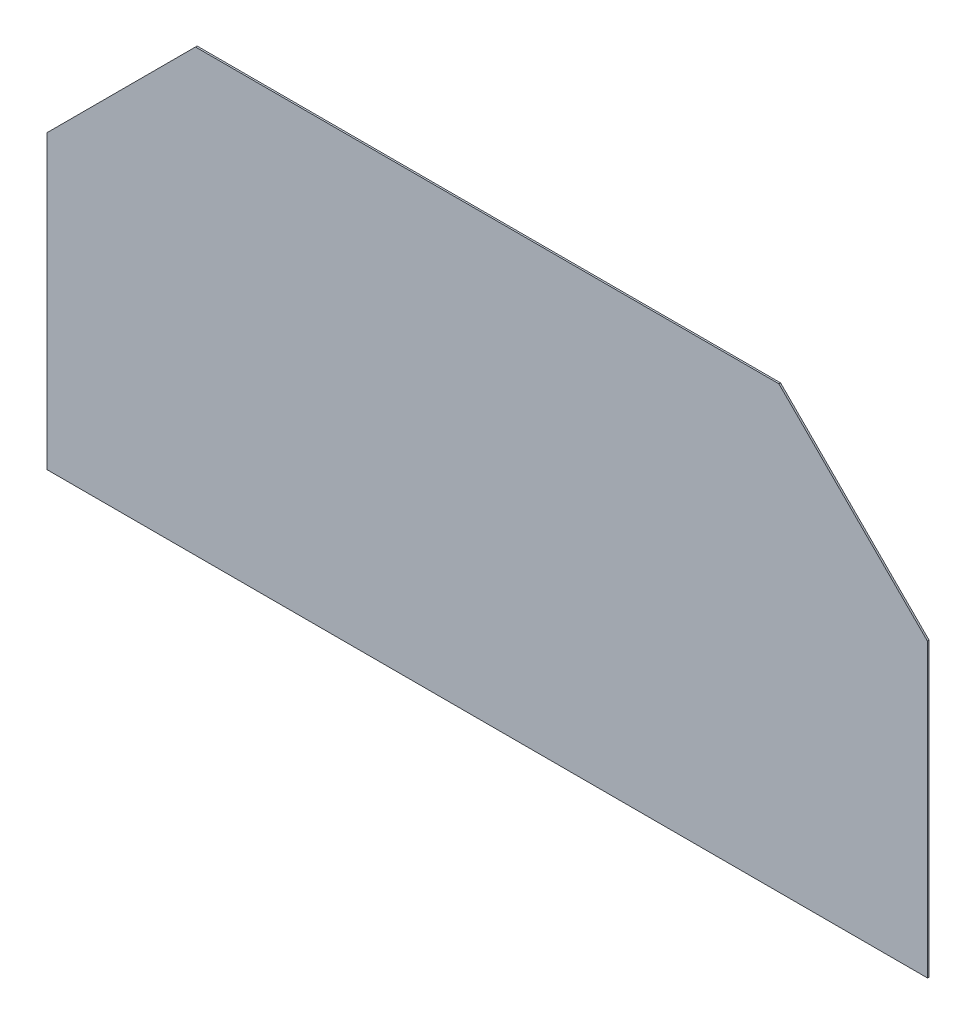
ISO-10303-21;
HEADER;
FILE_DESCRIPTION(('STEP AP214'),'2;1');
FILE_NAME('part.step','',(''),(''),'','','');
FILE_SCHEMA(('AUTOMOTIVE_DESIGN { 1 0 10303 214 1 1 1 1 }'));
ENDSEC;
DATA;
#1=APPLICATION_CONTEXT('core data for automotive mechanical design processes');
#2=APPLICATION_PROTOCOL_DEFINITION('international standard','automotive_design',2000,#1);
#3=PRODUCT_CONTEXT('',#1,'mechanical');
#4=PRODUCT('Part','Part','',(#3));
#5=PRODUCT_RELATED_PRODUCT_CATEGORY('part','',(#4));
#6=PRODUCT_DEFINITION_FORMATION('','',#4);
#7=PRODUCT_DEFINITION_CONTEXT('part definition',#1,'design');
#8=PRODUCT_DEFINITION('design','',#6,#7);
#9=PRODUCT_DEFINITION_SHAPE('','',#8);
#10=(LENGTH_UNIT() NAMED_UNIT(*) SI_UNIT(.MILLI.,.METRE.));
#11=(NAMED_UNIT(*) PLANE_ANGLE_UNIT() SI_UNIT($,.RADIAN.));
#12=(NAMED_UNIT(*) SI_UNIT($,.STERADIAN.) SOLID_ANGLE_UNIT());
#13=UNCERTAINTY_MEASURE_WITH_UNIT(LENGTH_MEASURE(1.E-05),#10,'distance_accuracy_value','');
#14=(GEOMETRIC_REPRESENTATION_CONTEXT(3) GLOBAL_UNCERTAINTY_ASSIGNED_CONTEXT((#13)) GLOBAL_UNIT_ASSIGNED_CONTEXT((#10,
#11,#12)) REPRESENTATION_CONTEXT('',''));
#15=CARTESIAN_POINT('',(0.,0.,0.));
#16=DIRECTION('',(0.,0.,1.));
#17=DIRECTION('',(1.,0.,0.));
#18=AXIS2_PLACEMENT_3D('',#15,#16,#17);
#19=CARTESIAN_POINT('',(20.,-5.54473320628,0.15));
#20=DIRECTION('',(0.,0.,1.));
#21=DIRECTION('',(1.,0.,0.));
#22=AXIS2_PLACEMENT_3D('',#19,#20,#21);
#23=PLANE('',#22);
#24=DIRECTION('',(1.,0.,0.));
#25=VECTOR('',#24,1.);
#26=CARTESIAN_POINT('',(-6.5,16.203007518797,0.15));
#27=LINE('',#26,#25);
#28=CARTESIAN_POINT('',(-6.5,16.203007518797,0.15));
#29=VERTEX_POINT('',#28);
#30=CARTESIAN_POINT('',(46.5,16.203007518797,0.15));
#31=VERTEX_POINT('',#30);
#32=EDGE_CURVE('E66',#29,#31,#27,.T.);
#33=ORIENTED_EDGE('',*,*,#32,.F.);
#34=DIRECTION('',(-0.707106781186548,-0.707106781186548,0.));
#35=VECTOR('',#34,1.);
#36=CARTESIAN_POINT('',(-20.,2.703007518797,0.15));
#37=LINE('',#36,#35);
#38=CARTESIAN_POINT('',(-20.,2.703007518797,0.15));
#39=VERTEX_POINT('',#38);
#40=EDGE_CURVE('E93',#39,#29,#37,.F.);
#41=ORIENTED_EDGE('',*,*,#40,.F.);
#42=DIRECTION('',(0.,1.,0.));
#43=VECTOR('',#42,1.);
#44=CARTESIAN_POINT('',(-20.,-23.7969924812,0.15));
#45=LINE('',#44,#43);
#46=CARTESIAN_POINT('',(-20.,-23.7969924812,0.15));
#47=VERTEX_POINT('',#46);
#48=EDGE_CURVE('E97',#47,#39,#45,.T.);
#49=ORIENTED_EDGE('',*,*,#48,.F.);
#50=DIRECTION('',(1.,0.,0.));
#51=VECTOR('',#50,1.);
#52=CARTESIAN_POINT('',(60.,-23.7969924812,0.15));
#53=LINE('',#52,#51);
#54=CARTESIAN_POINT('',(60.,-23.7969924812,0.15));
#55=VERTEX_POINT('',#54);
#56=EDGE_CURVE('E82',#55,#47,#53,.F.);
#57=ORIENTED_EDGE('',*,*,#56,.F.);
#58=DIRECTION('',(0.,1.,0.));
#59=VECTOR('',#58,1.);
#60=CARTESIAN_POINT('',(60.,2.703007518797,0.15));
#61=LINE('',#60,#59);
#62=CARTESIAN_POINT('',(60.,2.703007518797,0.15));
#63=VERTEX_POINT('',#62);
#64=EDGE_CURVE('E20',#63,#55,#61,.F.);
#65=ORIENTED_EDGE('',*,*,#64,.F.);
#66=DIRECTION('',(-0.707106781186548,0.707106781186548,0.));
#67=VECTOR('',#66,1.);
#68=CARTESIAN_POINT('',(46.5,16.203007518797,0.15));
#69=LINE('',#68,#67);
#70=EDGE_CURVE('E71',#31,#63,#69,.F.);
#71=ORIENTED_EDGE('',*,*,#70,.F.);
#72=EDGE_LOOP('',(#33,#41,#49,#57,#65,#71));
#73=FACE_BOUND('',#72,.T.);
#74=ADVANCED_FACE('F17',(#73),#23,.T.);
#75=CARTESIAN_POINT('',(60.,2.703007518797,0.));
#76=DIRECTION('',(1.,0.,0.));
#77=DIRECTION('',(0.,0.,-1.));
#78=AXIS2_PLACEMENT_3D('',#75,#76,#77);
#79=PLANE('',#78);
#80=DIRECTION('',(0.,1.,0.));
#81=VECTOR('',#80,1.);
#82=CARTESIAN_POINT('',(60.,-5.54473320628,0.));
#83=LINE('',#82,#81);
#84=CARTESIAN_POINT('',(60.,-23.7969924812,0.));
#85=VERTEX_POINT('',#84);
#86=CARTESIAN_POINT('',(60.,2.703007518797,0.));
#87=VERTEX_POINT('',#86);
#88=EDGE_CURVE('E88',#85,#87,#83,.T.);
#89=ORIENTED_EDGE('',*,*,#88,.T.);
#90=DIRECTION('',(0.,0.,1.));
#91=VECTOR('',#90,1.);
#92=CARTESIAN_POINT('',(60.,2.703007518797,0.));
#93=LINE('',#92,#91);
#94=EDGE_CURVE('E76',#63,#87,#93,.F.);
#95=ORIENTED_EDGE('',*,*,#94,.F.);
#96=ORIENTED_EDGE('',*,*,#64,.T.);
#97=DIRECTION('',(0.,0.,-1.));
#98=VECTOR('',#97,1.);
#99=CARTESIAN_POINT('',(60.,-23.7969924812,0.));
#100=LINE('',#99,#98);
#101=EDGE_CURVE('E103',#85,#55,#100,.F.);
#102=ORIENTED_EDGE('',*,*,#101,.F.);
#103=EDGE_LOOP('',(#89,#95,#96,#102));
#104=FACE_BOUND('',#103,.T.);
#105=ADVANCED_FACE('F87',(#104),#79,.T.);
#106=CARTESIAN_POINT('',(46.5,16.203007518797,0.));
#107=DIRECTION('',(0.707106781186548,0.707106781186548,0.));
#108=DIRECTION('',(-0.707106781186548,0.707106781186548,0.));
#109=AXIS2_PLACEMENT_3D('',#106,#107,#108);
#110=PLANE('',#109);
#111=DIRECTION('',(-0.707106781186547,0.707106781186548,0.));
#112=VECTOR('',#111,1.);
#113=CARTESIAN_POINT('',(60.,2.703007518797,0.));
#114=LINE('',#113,#112);
#115=CARTESIAN_POINT('',(46.5,16.203007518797,0.));
#116=VERTEX_POINT('',#115);
#117=EDGE_CURVE('E106',#87,#116,#114,.T.);
#118=ORIENTED_EDGE('',*,*,#117,.T.);
#119=DIRECTION('',(0.,0.,1.));
#120=VECTOR('',#119,1.);
#121=CARTESIAN_POINT('',(46.5,16.203007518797,0.));
#122=LINE('',#121,#120);
#123=EDGE_CURVE('E78',#31,#116,#122,.F.);
#124=ORIENTED_EDGE('',*,*,#123,.F.);
#125=ORIENTED_EDGE('',*,*,#70,.T.);
#126=ORIENTED_EDGE('',*,*,#94,.T.);
#127=EDGE_LOOP('',(#118,#124,#125,#126));
#128=FACE_BOUND('',#127,.T.);
#129=ADVANCED_FACE('F74',(#128),#110,.T.);
#130=CARTESIAN_POINT('',(-6.5,16.203007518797,0.));
#131=DIRECTION('',(0.,1.,0.));
#132=DIRECTION('',(0.,0.,1.));
#133=AXIS2_PLACEMENT_3D('',#130,#131,#132);
#134=PLANE('',#133);
#135=DIRECTION('',(1.,0.,0.));
#136=VECTOR('',#135,1.);
#137=CARTESIAN_POINT('',(20.,16.203007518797,0.));
#138=LINE('',#137,#136);
#139=CARTESIAN_POINT('',(-6.5,16.203007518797,0.));
#140=VERTEX_POINT('',#139);
#141=EDGE_CURVE('E108',#116,#140,#138,.F.);
#142=ORIENTED_EDGE('',*,*,#141,.T.);
#143=DIRECTION('',(0.,0.,1.));
#144=VECTOR('',#143,1.);
#145=CARTESIAN_POINT('',(-6.5,16.203007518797,0.));
#146=LINE('',#145,#144);
#147=EDGE_CURVE('E95',#29,#140,#146,.F.);
#148=ORIENTED_EDGE('',*,*,#147,.F.);
#149=ORIENTED_EDGE('',*,*,#32,.T.);
#150=ORIENTED_EDGE('',*,*,#123,.T.);
#151=EDGE_LOOP('',(#142,#148,#149,#150));
#152=FACE_BOUND('',#151,.T.);
#153=ADVANCED_FACE('F126',(#152),#134,.T.);
#154=CARTESIAN_POINT('',(-20.,2.703007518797,0.));
#155=DIRECTION('',(-0.707106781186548,0.707106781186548,0.));
#156=DIRECTION('',(-0.707106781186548,-0.707106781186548,0.));
#157=AXIS2_PLACEMENT_3D('',#154,#155,#156);
#158=PLANE('',#157);
#159=DIRECTION('',(-0.707106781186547,-0.707106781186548,0.));
#160=VECTOR('',#159,1.);
#161=CARTESIAN_POINT('',(-6.5,16.203007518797,0.));
#162=LINE('',#161,#160);
#163=CARTESIAN_POINT('',(-20.,2.703007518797,0.));
#164=VERTEX_POINT('',#163);
#165=EDGE_CURVE('E111',#140,#164,#162,.T.);
#166=ORIENTED_EDGE('',*,*,#165,.T.);
#167=DIRECTION('',(0.,0.,1.));
#168=VECTOR('',#167,1.);
#169=CARTESIAN_POINT('',(-20.,2.703007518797,0.));
#170=LINE('',#169,#168);
#171=EDGE_CURVE('E99',#39,#164,#170,.F.);
#172=ORIENTED_EDGE('',*,*,#171,.F.);
#173=ORIENTED_EDGE('',*,*,#40,.T.);
#174=ORIENTED_EDGE('',*,*,#147,.T.);
#175=EDGE_LOOP('',(#166,#172,#173,#174));
#176=FACE_BOUND('',#175,.T.);
#177=ADVANCED_FACE('F124',(#176),#158,.T.);
#178=CARTESIAN_POINT('',(-20.,-23.7969924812,0.));
#179=DIRECTION('',(-1.,0.,0.));
#180=DIRECTION('',(0.,0.,1.));
#181=AXIS2_PLACEMENT_3D('',#178,#179,#180);
#182=PLANE('',#181);
#183=DIRECTION('',(0.,1.,0.));
#184=VECTOR('',#183,1.);
#185=CARTESIAN_POINT('',(-20.,-5.54473320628,0.));
#186=LINE('',#185,#184);
#187=CARTESIAN_POINT('',(-20.,-23.7969924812,0.));
#188=VERTEX_POINT('',#187);
#189=EDGE_CURVE('E26',#164,#188,#186,.F.);
#190=ORIENTED_EDGE('',*,*,#189,.T.);
#191=DIRECTION('',(0.,0.,-1.));
#192=VECTOR('',#191,1.);
#193=CARTESIAN_POINT('',(-20.,-23.7969924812,0.));
#194=LINE('',#193,#192);
#195=EDGE_CURVE('E34',#47,#188,#194,.T.);
#196=ORIENTED_EDGE('',*,*,#195,.F.);
#197=ORIENTED_EDGE('',*,*,#48,.T.);
#198=ORIENTED_EDGE('',*,*,#171,.T.);
#199=EDGE_LOOP('',(#190,#196,#197,#198));
#200=FACE_BOUND('',#199,.T.);
#201=ADVANCED_FACE('F117',(#200),#182,.T.);
#202=CARTESIAN_POINT('',(60.,-23.7969924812,0.));
#203=DIRECTION('',(0.,-1.,0.));
#204=DIRECTION('',(0.,0.,-1.));
#205=AXIS2_PLACEMENT_3D('',#202,#203,#204);
#206=PLANE('',#205);
#207=DIRECTION('',(1.,0.,0.));
#208=VECTOR('',#207,1.);
#209=CARTESIAN_POINT('',(20.,-23.7969924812,0.));
#210=LINE('',#209,#208);
#211=EDGE_CURVE('E11',#188,#85,#210,.T.);
#212=ORIENTED_EDGE('',*,*,#211,.T.);
#213=ORIENTED_EDGE('',*,*,#101,.T.);
#214=ORIENTED_EDGE('',*,*,#56,.T.);
#215=ORIENTED_EDGE('',*,*,#195,.T.);
#216=EDGE_LOOP('',(#212,#213,#214,#215));
#217=FACE_BOUND('',#216,.T.);
#218=ADVANCED_FACE('F127',(#217),#206,.T.);
#219=CARTESIAN_POINT('',(20.,-5.54473320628,0.));
#220=DIRECTION('',(0.,0.,1.));
#221=DIRECTION('',(1.,0.,0.));
#222=AXIS2_PLACEMENT_3D('',#219,#220,#221);
#223=PLANE('',#222);
#224=ORIENTED_EDGE('',*,*,#189,.F.);
#225=ORIENTED_EDGE('',*,*,#165,.F.);
#226=ORIENTED_EDGE('',*,*,#141,.F.);
#227=ORIENTED_EDGE('',*,*,#117,.F.);
#228=ORIENTED_EDGE('',*,*,#88,.F.);
#229=ORIENTED_EDGE('',*,*,#211,.F.);
#230=EDGE_LOOP('',(#224,#225,#226,#227,#228,#229));
#231=FACE_BOUND('',#230,.T.);
#232=ADVANCED_FACE('F121',(#231),#223,.F.);
#233=CLOSED_SHELL('',(#74,#105,#129,#153,#177,#201,#218,#232));
#234=MANIFOLD_SOLID_BREP('B1',#233);
#235=ADVANCED_BREP_SHAPE_REPRESENTATION('',(#18,#234),#14);
#236=SHAPE_DEFINITION_REPRESENTATION(#9,#235);
ENDSEC;
END-ISO-10303-21;
